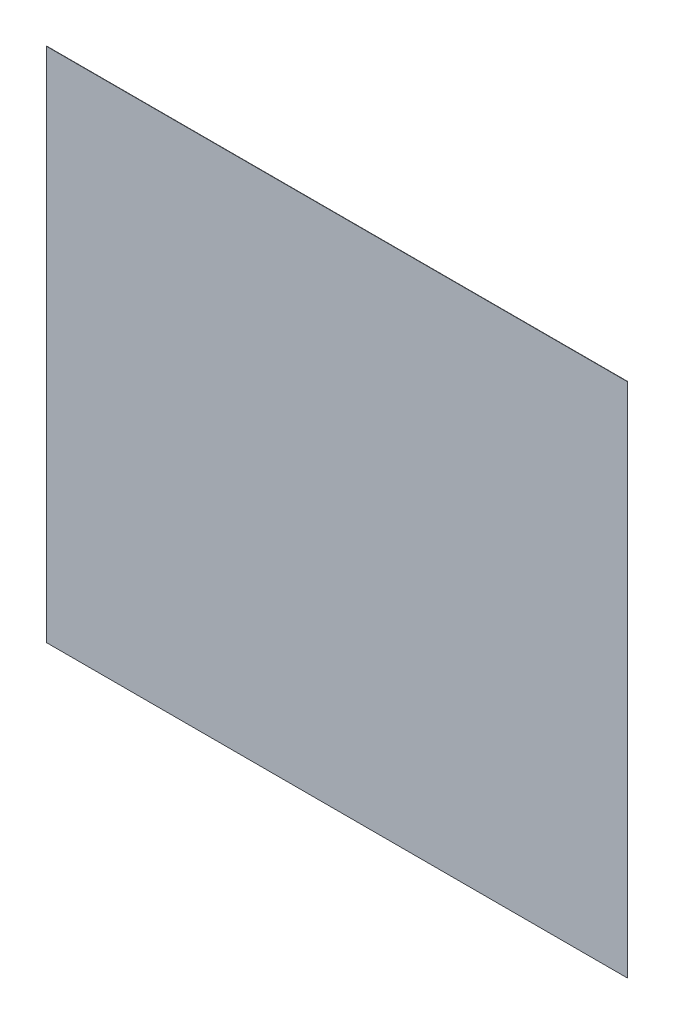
from build123d import *

# Parameters (mm, degrees)
CROQUIS1_W              = 180
CROQUIS1_H              = 160
SALIENTE_EXTRUIR1_DEPTH = 0.1


with BuildPart() as part:
    # Croquis1 → Saliente-Extruir1 (new body)
    with BuildSketch(Plane.XY):
        Rectangle(CROQUIS1_W, CROQUIS1_H)
    extrude(amount=SALIENTE_EXTRUIR1_DEPTH)


solid = part.part
